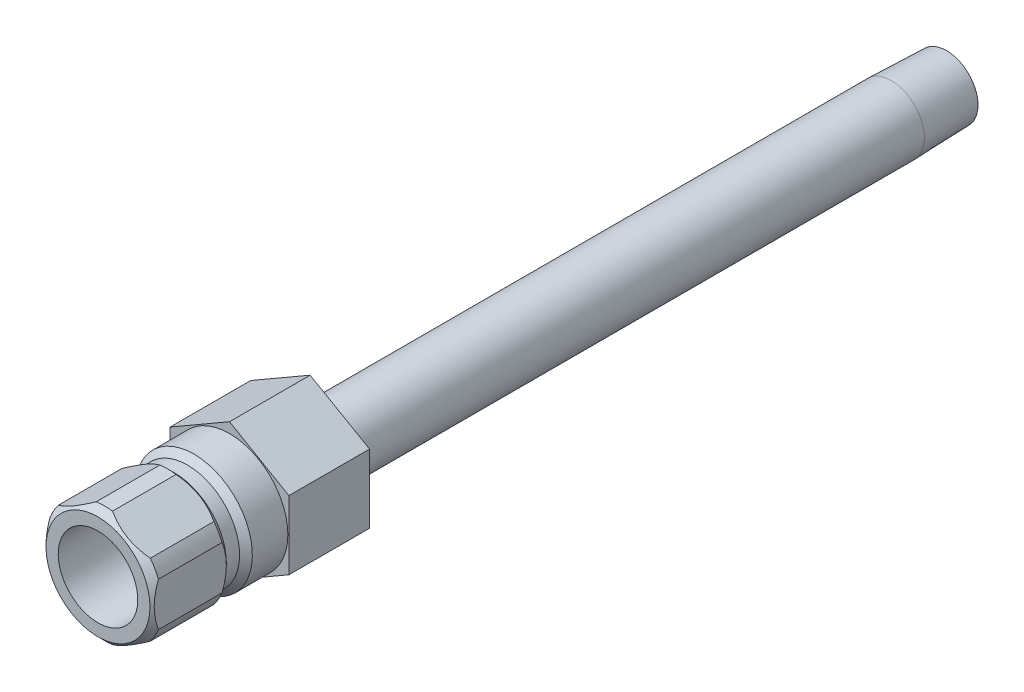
from build123d import *

# Parameters (mm, degrees)
SKETCH2_R           = 2.6543
BOSS_EXTRUDE1_DEPTH = 9.652
CUT_EXTRUDE1_START  = 6.604
SKETCH3_OUTSIDE_W   = 37.004
SKETCH3_OUTSIDE_H   = 39.204
CUT_EXTRUDE1_DEPTH  = 80.932623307


with BuildPart() as part:
    # Sketch1 → Revolve1 (revolve)
    with BuildSketch(Plane(origin=(0, 0, 0), x_dir=(0, 0, -1), z_dir=(1, 0, 0))):
        Polygon((-15.748, 4.7625), (-15.748, 6.223), (-14.986, 6.985), (-7.366, 6.985), (-6.604, 6.223), (-5.0165, 6.223), (-4.2545, 6.985), (9.652, 6.985), (9.652, 3.96875), (79.2226, 3.96875), (85.852, 3.761582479), (85.852, 2.6543), (-2.435050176, 2.6543), (-3.556, 4.7625), align=None)
    revolve(axis=Axis((0, 0, -9.652), (0, 0, 1)))

    # Sketch2 → Boss-Extrude1 (add)
    with BuildSketch(Plane.XY):
        Polygon((-7.112, 4.106115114), (-7.112, -4.106115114), (0, -8.212230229), (7.112, -4.106115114), (7.112, 4.106115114), (0, 8.212230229), align=None)
        with Locations(Location((0, 0, 0), (0, 0, 90))):
            Circle(SKETCH2_R, mode=Mode.SUBTRACT)
    extrude(amount=-BOSS_EXTRUDE1_DEPTH)

    # Sketch3 outside → Cut-Extrude1 (cut, through all)
    with BuildSketch(Plane.XY.offset(CUT_EXTRUDE1_START)):
        Rectangle(SKETCH3_OUTSIDE_W, SKETCH3_OUTSIDE_H)
        Polygon((6.477, 3.739497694), (0, 7.478995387), (-6.477, 3.739497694), (-6.477, -3.739497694), (0, -7.478995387), (6.477, -3.739497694), align=None, mode=Mode.SUBTRACT)
    extrude(amount=CUT_EXTRUDE1_DEPTH, mode=Mode.SUBTRACT)


solid = part.part
